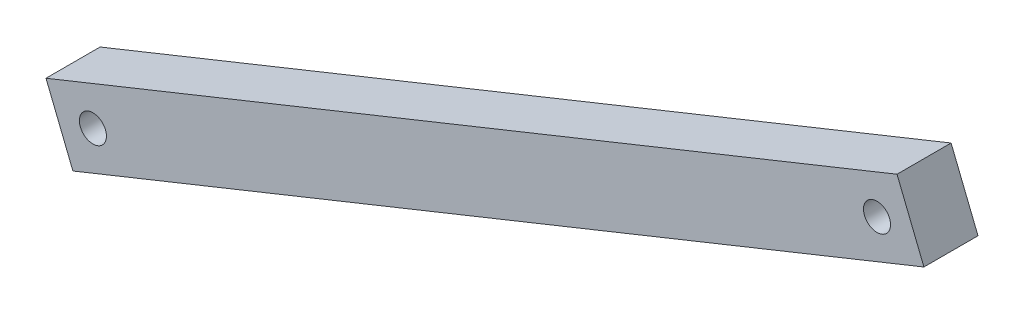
from build123d import *

# Parameters (mm, degrees)
ESQUISSE1_R      = 1.5
EXTRUSION1_DEPTH = 6


with BuildPart() as part:
    # Esquisse1 → Extrusion1 (new body)
    with BuildSketch(Plane.XY):
        Polygon((-2.21804373, 81.796128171), (92.203871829, 119.78195627), (89.21804373, 127.203871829), (-5.203871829, 89.21804373), align=None)
        with Locations((87, 122)):
            Circle(ESQUISSE1_R, mode=Mode.SUBTRACT)
        with Locations((0, 87)):
            Circle(ESQUISSE1_R, mode=Mode.SUBTRACT)
    extrude(amount=EXTRUSION1_DEPTH)


solid = part.part
